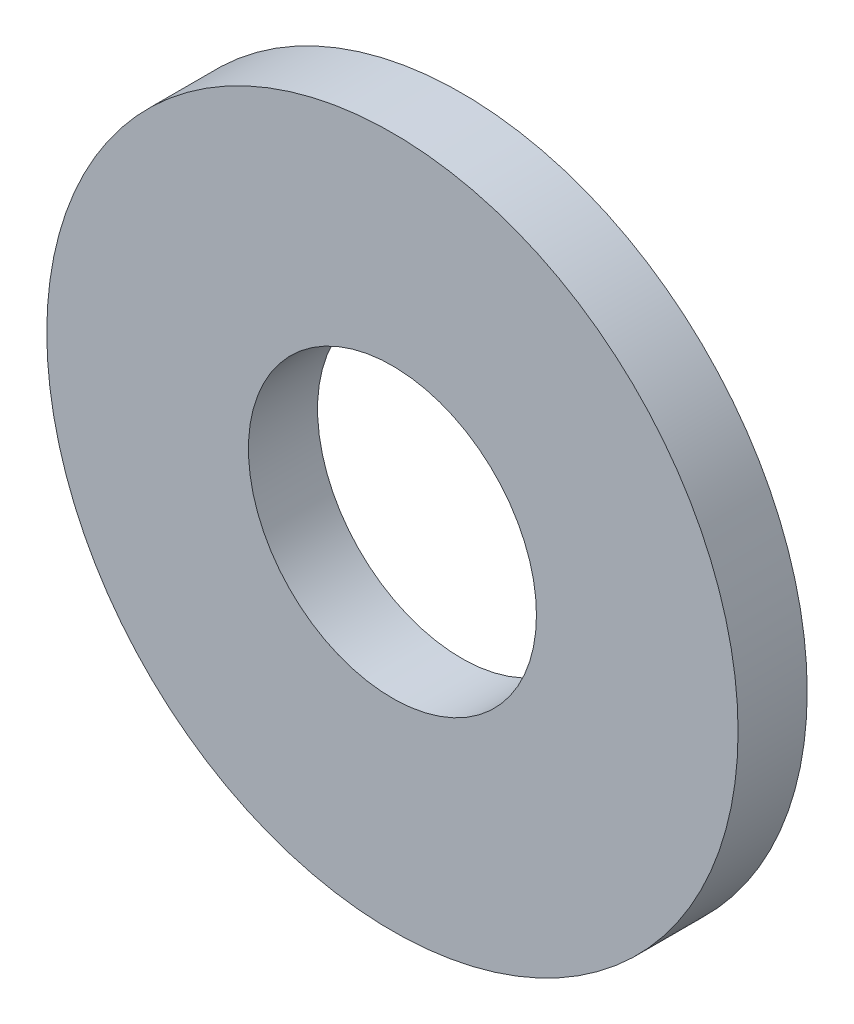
ISO-10303-21;
HEADER;
FILE_DESCRIPTION(('STEP AP214'),'2;1');
FILE_NAME('part.step','',(''),(''),'','','');
FILE_SCHEMA(('AUTOMOTIVE_DESIGN { 1 0 10303 214 1 1 1 1 }'));
ENDSEC;
DATA;
#1=APPLICATION_CONTEXT('core data for automotive mechanical design processes');
#2=APPLICATION_PROTOCOL_DEFINITION('international standard','automotive_design',2000,#1);
#3=PRODUCT_CONTEXT('',#1,'mechanical');
#4=PRODUCT('Part','Part','',(#3));
#5=PRODUCT_RELATED_PRODUCT_CATEGORY('part','',(#4));
#6=PRODUCT_DEFINITION_FORMATION('','',#4);
#7=PRODUCT_DEFINITION_CONTEXT('part definition',#1,'design');
#8=PRODUCT_DEFINITION('design','',#6,#7);
#9=PRODUCT_DEFINITION_SHAPE('','',#8);
#10=(LENGTH_UNIT() NAMED_UNIT(*) SI_UNIT(.MILLI.,.METRE.));
#11=(NAMED_UNIT(*) PLANE_ANGLE_UNIT() SI_UNIT($,.RADIAN.));
#12=(NAMED_UNIT(*) SI_UNIT($,.STERADIAN.) SOLID_ANGLE_UNIT());
#13=UNCERTAINTY_MEASURE_WITH_UNIT(LENGTH_MEASURE(1.E-05),#10,'distance_accuracy_value','');
#14=(GEOMETRIC_REPRESENTATION_CONTEXT(3) GLOBAL_UNCERTAINTY_ASSIGNED_CONTEXT((#13)) GLOBAL_UNIT_ASSIGNED_CONTEXT((#10,
#11,#12)) REPRESENTATION_CONTEXT('',''));
#15=CARTESIAN_POINT('',(0.,0.,0.));
#16=DIRECTION('',(0.,0.,1.));
#17=DIRECTION('',(1.,0.,0.));
#18=AXIS2_PLACEMENT_3D('',#15,#16,#17);
#19=CARTESIAN_POINT('',(0.,0.,0.6));
#20=DIRECTION('',(0.,0.,1.));
#21=DIRECTION('',(1.,0.,0.));
#22=AXIS2_PLACEMENT_3D('',#19,#20,#21);
#23=PLANE('',#22);
#24=CARTESIAN_POINT('',(0.,0.,0.6));
#25=DIRECTION('',(0.,0.,1.));
#26=DIRECTION('',(1.,0.,0.));
#27=AXIS2_PLACEMENT_3D('',#24,#25,#26);
#28=CIRCLE('',#27,3.);
#29=CARTESIAN_POINT('',(3.,0.,0.6));
#30=VERTEX_POINT('',#29);
#31=EDGE_CURVE('E10',#30,#30,#28,.T.);
#32=ORIENTED_EDGE('',*,*,#31,.T.);
#33=EDGE_LOOP('',(#32));
#34=FACE_BOUND('',#33,.T.);
#35=CARTESIAN_POINT('',(0.,0.,0.6));
#36=DIRECTION('',(0.,0.,1.));
#37=DIRECTION('',(1.,0.,0.));
#38=AXIS2_PLACEMENT_3D('',#35,#36,#37);
#39=CIRCLE('',#38,1.25);
#40=CARTESIAN_POINT('',(1.25,0.,0.6));
#41=VERTEX_POINT('',#40);
#42=EDGE_CURVE('E43',#41,#41,#39,.T.);
#43=ORIENTED_EDGE('',*,*,#42,.F.);
#44=EDGE_LOOP('',(#43));
#45=FACE_BOUND('',#44,.T.);
#46=ADVANCED_FACE('F32',(#34,#45),#23,.T.);
#47=CARTESIAN_POINT('',(0.,0.,0.));
#48=DIRECTION('',(0.,0.,1.));
#49=DIRECTION('',(1.,0.,0.));
#50=AXIS2_PLACEMENT_3D('',#47,#48,#49);
#51=PLANE('',#50);
#52=CARTESIAN_POINT('',(0.,0.,0.));
#53=DIRECTION('',(0.,0.,1.));
#54=DIRECTION('',(1.,0.,0.));
#55=AXIS2_PLACEMENT_3D('',#52,#53,#54);
#56=CIRCLE('',#55,3.);
#57=CARTESIAN_POINT('',(3.,0.,0.));
#58=VERTEX_POINT('',#57);
#59=EDGE_CURVE('E36',#58,#58,#56,.T.);
#60=ORIENTED_EDGE('',*,*,#59,.F.);
#61=EDGE_LOOP('',(#60));
#62=FACE_BOUND('',#61,.T.);
#63=CARTESIAN_POINT('',(0.,0.,0.));
#64=DIRECTION('',(0.,0.,1.));
#65=DIRECTION('',(1.,0.,0.));
#66=AXIS2_PLACEMENT_3D('',#63,#64,#65);
#67=CIRCLE('',#66,1.25);
#68=CARTESIAN_POINT('',(1.25,0.,0.));
#69=VERTEX_POINT('',#68);
#70=EDGE_CURVE('E45',#69,#69,#67,.T.);
#71=ORIENTED_EDGE('',*,*,#70,.T.);
#72=EDGE_LOOP('',(#71));
#73=FACE_BOUND('',#72,.T.);
#74=ADVANCED_FACE('F55',(#62,#73),#51,.F.);
#75=CARTESIAN_POINT('',(0.,0.,0.6));
#76=DIRECTION('',(0.,0.,-1.));
#77=DIRECTION('',(-1.,0.,0.));
#78=AXIS2_PLACEMENT_3D('',#75,#76,#77);
#79=CYLINDRICAL_SURFACE('',#78,3.);
#80=ORIENTED_EDGE('',*,*,#31,.F.);
#81=EDGE_LOOP('',(#80));
#82=FACE_BOUND('',#81,.T.);
#83=ORIENTED_EDGE('',*,*,#59,.T.);
#84=EDGE_LOOP('',(#83));
#85=FACE_BOUND('',#84,.T.);
#86=ADVANCED_FACE('F34',(#82,#85),#79,.T.);
#87=CARTESIAN_POINT('',(0.,0.,0.6));
#88=DIRECTION('',(0.,0.,-1.));
#89=DIRECTION('',(-1.,0.,0.));
#90=AXIS2_PLACEMENT_3D('',#87,#88,#89);
#91=CYLINDRICAL_SURFACE('',#90,1.25);
#92=ORIENTED_EDGE('',*,*,#42,.T.);
#93=EDGE_LOOP('',(#92));
#94=FACE_BOUND('',#93,.T.);
#95=ORIENTED_EDGE('',*,*,#70,.F.);
#96=EDGE_LOOP('',(#95));
#97=FACE_BOUND('',#96,.T.);
#98=ADVANCED_FACE('F51',(#94,#97),#91,.F.);
#99=CLOSED_SHELL('',(#46,#74,#86,#98));
#100=MANIFOLD_SOLID_BREP('B2',#99);
#101=ADVANCED_BREP_SHAPE_REPRESENTATION('',(#18,#100),#14);
#102=SHAPE_DEFINITION_REPRESENTATION(#9,#101);
ENDSEC;
END-ISO-10303-21;
